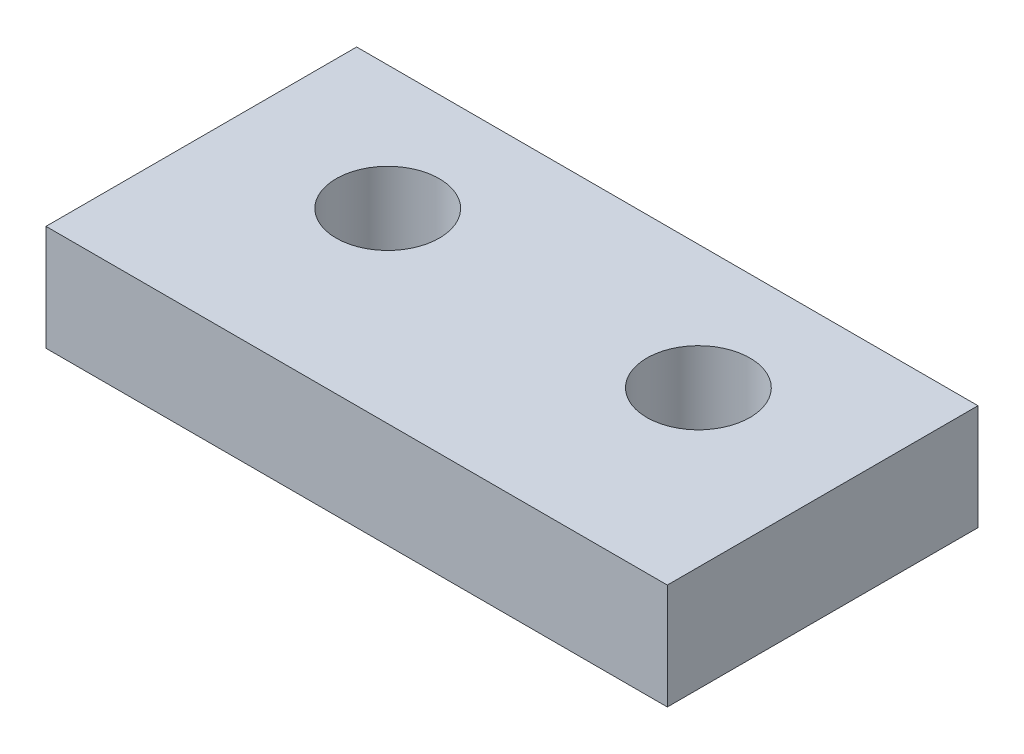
ISO-10303-21;
HEADER;
FILE_DESCRIPTION(('STEP AP214'),'2;1');
FILE_NAME('part.step','',(''),(''),'','','');
FILE_SCHEMA(('AUTOMOTIVE_DESIGN { 1 0 10303 214 1 1 1 1 }'));
ENDSEC;
DATA;
#1=APPLICATION_CONTEXT('core data for automotive mechanical design processes');
#2=APPLICATION_PROTOCOL_DEFINITION('international standard','automotive_design',2000,#1);
#3=PRODUCT_CONTEXT('',#1,'mechanical');
#4=PRODUCT('Part','Part','',(#3));
#5=PRODUCT_RELATED_PRODUCT_CATEGORY('part','',(#4));
#6=PRODUCT_DEFINITION_FORMATION('','',#4);
#7=PRODUCT_DEFINITION_CONTEXT('part definition',#1,'design');
#8=PRODUCT_DEFINITION('design','',#6,#7);
#9=PRODUCT_DEFINITION_SHAPE('','',#8);
#10=(LENGTH_UNIT() NAMED_UNIT(*) SI_UNIT(.MILLI.,.METRE.));
#11=(NAMED_UNIT(*) PLANE_ANGLE_UNIT() SI_UNIT($,.RADIAN.));
#12=(NAMED_UNIT(*) SI_UNIT($,.STERADIAN.) SOLID_ANGLE_UNIT());
#13=UNCERTAINTY_MEASURE_WITH_UNIT(LENGTH_MEASURE(1.E-05),#10,'distance_accuracy_value','');
#14=(GEOMETRIC_REPRESENTATION_CONTEXT(3) GLOBAL_UNCERTAINTY_ASSIGNED_CONTEXT((#13)) GLOBAL_UNIT_ASSIGNED_CONTEXT((#10,
#11,#12)) REPRESENTATION_CONTEXT('',''));
#15=CARTESIAN_POINT('',(0.,0.,0.));
#16=DIRECTION('',(0.,0.,1.));
#17=DIRECTION('',(1.,0.,0.));
#18=AXIS2_PLACEMENT_3D('',#15,#16,#17);
#19=CARTESIAN_POINT('',(-25.,8.5,12.5));
#20=DIRECTION('',(0.,0.,-1.));
#21=DIRECTION('',(0.,-1.,0.));
#22=AXIS2_PLACEMENT_3D('',#19,#20,#21);
#23=PLANE('',#22);
#24=DIRECTION('',(1.,0.,0.));
#25=VECTOR('',#24,1.);
#26=CARTESIAN_POINT('',(-25.,0.,12.5));
#27=LINE('',#26,#25);
#28=CARTESIAN_POINT('',(-25.,0.,12.5));
#29=VERTEX_POINT('',#28);
#30=CARTESIAN_POINT('',(25.,0.,12.5));
#31=VERTEX_POINT('',#30);
#32=EDGE_CURVE('E94',#29,#31,#27,.T.);
#33=ORIENTED_EDGE('',*,*,#32,.T.);
#34=DIRECTION('',(0.,-1.,0.));
#35=VECTOR('',#34,1.);
#36=CARTESIAN_POINT('',(25.,8.5,12.5));
#37=LINE('',#36,#35);
#38=CARTESIAN_POINT('',(25.,8.5,12.5));
#39=VERTEX_POINT('',#38);
#40=EDGE_CURVE('E66',#39,#31,#37,.T.);
#41=ORIENTED_EDGE('',*,*,#40,.F.);
#42=DIRECTION('',(1.,0.,0.));
#43=VECTOR('',#42,1.);
#44=CARTESIAN_POINT('',(-25.,8.5,12.5));
#45=LINE('',#44,#43);
#46=CARTESIAN_POINT('',(-25.,8.5,12.5));
#47=VERTEX_POINT('',#46);
#48=EDGE_CURVE('E95',#47,#39,#45,.T.);
#49=ORIENTED_EDGE('',*,*,#48,.F.);
#50=DIRECTION('',(0.,-1.,0.));
#51=VECTOR('',#50,1.);
#52=CARTESIAN_POINT('',(-25.,8.5,12.5));
#53=LINE('',#52,#51);
#54=EDGE_CURVE('E11',#47,#29,#53,.T.);
#55=ORIENTED_EDGE('',*,*,#54,.T.);
#56=EDGE_LOOP('',(#33,#41,#49,#55));
#57=FACE_BOUND('',#56,.T.);
#58=ADVANCED_FACE('F17',(#57),#23,.F.);
#59=CARTESIAN_POINT('',(-25.,8.5,12.5));
#60=DIRECTION('',(1.,0.,0.));
#61=DIRECTION('',(0.,1.,0.));
#62=AXIS2_PLACEMENT_3D('',#59,#60,#61);
#63=PLANE('',#62);
#64=DIRECTION('',(0.,0.,1.));
#65=VECTOR('',#64,1.);
#66=CARTESIAN_POINT('',(-25.,0.,12.5));
#67=LINE('',#66,#65);
#68=CARTESIAN_POINT('',(-25.,0.,-12.5));
#69=VERTEX_POINT('',#68);
#70=EDGE_CURVE('E89',#69,#29,#67,.T.);
#71=ORIENTED_EDGE('',*,*,#70,.T.);
#72=ORIENTED_EDGE('',*,*,#54,.F.);
#73=DIRECTION('',(0.,0.,1.));
#74=VECTOR('',#73,1.);
#75=CARTESIAN_POINT('',(-25.,8.5,12.5));
#76=LINE('',#75,#74);
#77=CARTESIAN_POINT('',(-25.,8.5,-12.5));
#78=VERTEX_POINT('',#77);
#79=EDGE_CURVE('E104',#78,#47,#76,.T.);
#80=ORIENTED_EDGE('',*,*,#79,.F.);
#81=DIRECTION('',(0.,-1.,0.));
#82=VECTOR('',#81,1.);
#83=CARTESIAN_POINT('',(-25.,8.5,-12.5));
#84=LINE('',#83,#82);
#85=EDGE_CURVE('E27',#78,#69,#84,.T.);
#86=ORIENTED_EDGE('',*,*,#85,.T.);
#87=EDGE_LOOP('',(#71,#72,#80,#86));
#88=FACE_BOUND('',#87,.T.);
#89=ADVANCED_FACE('F19',(#88),#63,.F.);
#90=CARTESIAN_POINT('',(-25.,8.5,-12.5));
#91=DIRECTION('',(0.,0.,1.));
#92=DIRECTION('',(1.,0.,0.));
#93=AXIS2_PLACEMENT_3D('',#90,#91,#92);
#94=PLANE('',#93);
#95=DIRECTION('',(-1.,0.,0.));
#96=VECTOR('',#95,1.);
#97=CARTESIAN_POINT('',(-25.,0.,-12.5));
#98=LINE('',#97,#96);
#99=CARTESIAN_POINT('',(25.,0.,-12.5));
#100=VERTEX_POINT('',#99);
#101=EDGE_CURVE('E77',#100,#69,#98,.T.);
#102=ORIENTED_EDGE('',*,*,#101,.T.);
#103=ORIENTED_EDGE('',*,*,#85,.F.);
#104=DIRECTION('',(-1.,0.,0.));
#105=VECTOR('',#104,1.);
#106=CARTESIAN_POINT('',(-25.,8.5,-12.5));
#107=LINE('',#106,#105);
#108=CARTESIAN_POINT('',(25.,8.5,-12.5));
#109=VERTEX_POINT('',#108);
#110=EDGE_CURVE('E80',#109,#78,#107,.T.);
#111=ORIENTED_EDGE('',*,*,#110,.F.);
#112=DIRECTION('',(0.,-1.,0.));
#113=VECTOR('',#112,1.);
#114=CARTESIAN_POINT('',(25.,8.5,-12.5));
#115=LINE('',#114,#113);
#116=EDGE_CURVE('E74',#109,#100,#115,.T.);
#117=ORIENTED_EDGE('',*,*,#116,.T.);
#118=EDGE_LOOP('',(#102,#103,#111,#117));
#119=FACE_BOUND('',#118,.T.);
#120=ADVANCED_FACE('F76',(#119),#94,.F.);
#121=CARTESIAN_POINT('',(25.,8.5,12.5));
#122=DIRECTION('',(-1.,0.,0.));
#123=DIRECTION('',(0.,0.,1.));
#124=AXIS2_PLACEMENT_3D('',#121,#122,#123);
#125=PLANE('',#124);
#126=DIRECTION('',(0.,0.,-1.));
#127=VECTOR('',#126,1.);
#128=CARTESIAN_POINT('',(25.,0.,12.5));
#129=LINE('',#128,#127);
#130=EDGE_CURVE('E88',#31,#100,#129,.T.);
#131=ORIENTED_EDGE('',*,*,#130,.T.);
#132=ORIENTED_EDGE('',*,*,#116,.F.);
#133=DIRECTION('',(0.,0.,-1.));
#134=VECTOR('',#133,1.);
#135=CARTESIAN_POINT('',(25.,8.5,12.5));
#136=LINE('',#135,#134);
#137=EDGE_CURVE('E154',#39,#109,#136,.T.);
#138=ORIENTED_EDGE('',*,*,#137,.F.);
#139=ORIENTED_EDGE('',*,*,#40,.T.);
#140=EDGE_LOOP('',(#131,#132,#138,#139));
#141=FACE_BOUND('',#140,.T.);
#142=ADVANCED_FACE('F92',(#141),#125,.F.);
#143=CARTESIAN_POINT('',(0.,0.,0.));
#144=DIRECTION('',(0.,-1.,0.));
#145=DIRECTION('',(0.,0.,-1.));
#146=AXIS2_PLACEMENT_3D('',#143,#144,#145);
#147=PLANE('',#146);
#148=CARTESIAN_POINT('',(12.5,0.,-2.5));
#149=DIRECTION('',(0.,1.,0.));
#150=DIRECTION('',(0.,0.,1.));
#151=AXIS2_PLACEMENT_3D('',#148,#149,#150);
#152=CIRCLE('',#151,4.15);
#153=CARTESIAN_POINT('',(12.5,0.,1.65));
#154=VERTEX_POINT('',#153);
#155=EDGE_CURVE('E311',#154,#154,#152,.T.);
#156=ORIENTED_EDGE('',*,*,#155,.T.);
#157=EDGE_LOOP('',(#156));
#158=FACE_BOUND('',#157,.T.);
#159=CARTESIAN_POINT('',(-12.5,0.,-2.5));
#160=DIRECTION('',(0.,1.,0.));
#161=DIRECTION('',(0.,0.,1.));
#162=AXIS2_PLACEMENT_3D('',#159,#160,#161);
#163=CIRCLE('',#162,4.15);
#164=CARTESIAN_POINT('',(-12.5,0.,1.65));
#165=VERTEX_POINT('',#164);
#166=EDGE_CURVE('E158',#165,#165,#163,.T.);
#167=ORIENTED_EDGE('',*,*,#166,.T.);
#168=EDGE_LOOP('',(#167));
#169=FACE_BOUND('',#168,.T.);
#170=ORIENTED_EDGE('',*,*,#130,.F.);
#171=ORIENTED_EDGE('',*,*,#32,.F.);
#172=ORIENTED_EDGE('',*,*,#70,.F.);
#173=ORIENTED_EDGE('',*,*,#101,.F.);
#174=EDGE_LOOP('',(#170,#171,#172,#173));
#175=FACE_BOUND('',#174,.T.);
#176=ADVANCED_FACE('F86',(#158,#169,#175),#147,.T.);
#177=CARTESIAN_POINT('',(0.,8.5,0.));
#178=DIRECTION('',(0.,-1.,0.));
#179=DIRECTION('',(0.,0.,-1.));
#180=AXIS2_PLACEMENT_3D('',#177,#178,#179);
#181=PLANE('',#180);
#182=CARTESIAN_POINT('',(12.5,8.5,-2.5));
#183=DIRECTION('',(0.,1.,0.));
#184=DIRECTION('',(0.,0.,1.));
#185=AXIS2_PLACEMENT_3D('',#182,#183,#184);
#186=CIRCLE('',#185,4.15);
#187=CARTESIAN_POINT('',(12.5,8.5,1.65));
#188=VERTEX_POINT('',#187);
#189=EDGE_CURVE('E318',#188,#188,#186,.T.);
#190=ORIENTED_EDGE('',*,*,#189,.F.);
#191=EDGE_LOOP('',(#190));
#192=FACE_BOUND('',#191,.T.);
#193=CARTESIAN_POINT('',(-12.5,8.5,-2.5));
#194=DIRECTION('',(0.,1.,0.));
#195=DIRECTION('',(0.,0.,1.));
#196=AXIS2_PLACEMENT_3D('',#193,#194,#195);
#197=CIRCLE('',#196,4.15);
#198=CARTESIAN_POINT('',(-12.5,8.5,1.65));
#199=VERTEX_POINT('',#198);
#200=EDGE_CURVE('E150',#199,#199,#197,.T.);
#201=ORIENTED_EDGE('',*,*,#200,.F.);
#202=EDGE_LOOP('',(#201));
#203=FACE_BOUND('',#202,.T.);
#204=ORIENTED_EDGE('',*,*,#137,.T.);
#205=ORIENTED_EDGE('',*,*,#110,.T.);
#206=ORIENTED_EDGE('',*,*,#79,.T.);
#207=ORIENTED_EDGE('',*,*,#48,.T.);
#208=EDGE_LOOP('',(#204,#205,#206,#207));
#209=FACE_BOUND('',#208,.T.);
#210=ADVANCED_FACE('F206',(#192,#203,#209),#181,.F.);
#211=CARTESIAN_POINT('',(-12.5,8.5,-2.5));
#212=DIRECTION('',(0.,-1.,0.));
#213=DIRECTION('',(0.,0.,-1.));
#214=AXIS2_PLACEMENT_3D('',#211,#212,#213);
#215=CYLINDRICAL_SURFACE('',#214,4.15);
#216=ORIENTED_EDGE('',*,*,#166,.F.);
#217=EDGE_LOOP('',(#216));
#218=FACE_BOUND('',#217,.T.);
#219=ORIENTED_EDGE('',*,*,#200,.T.);
#220=EDGE_LOOP('',(#219));
#221=FACE_BOUND('',#220,.T.);
#222=ADVANCED_FACE('F198',(#218,#221),#215,.F.);
#223=CARTESIAN_POINT('',(12.5,8.5,-2.5));
#224=DIRECTION('',(0.,-1.,0.));
#225=DIRECTION('',(0.,0.,-1.));
#226=AXIS2_PLACEMENT_3D('',#223,#224,#225);
#227=CYLINDRICAL_SURFACE('',#226,4.15);
#228=ORIENTED_EDGE('',*,*,#155,.F.);
#229=EDGE_LOOP('',(#228));
#230=FACE_BOUND('',#229,.T.);
#231=ORIENTED_EDGE('',*,*,#189,.T.);
#232=EDGE_LOOP('',(#231));
#233=FACE_BOUND('',#232,.T.);
#234=ADVANCED_FACE('F194',(#230,#233),#227,.F.);
#235=CLOSED_SHELL('',(#58,#89,#120,#142,#176,#210,#222,#234));
#236=MANIFOLD_SOLID_BREP('B1',#235);
#237=ADVANCED_BREP_SHAPE_REPRESENTATION('',(#18,#236),#14);
#238=SHAPE_DEFINITION_REPRESENTATION(#9,#237);
ENDSEC;
END-ISO-10303-21;
